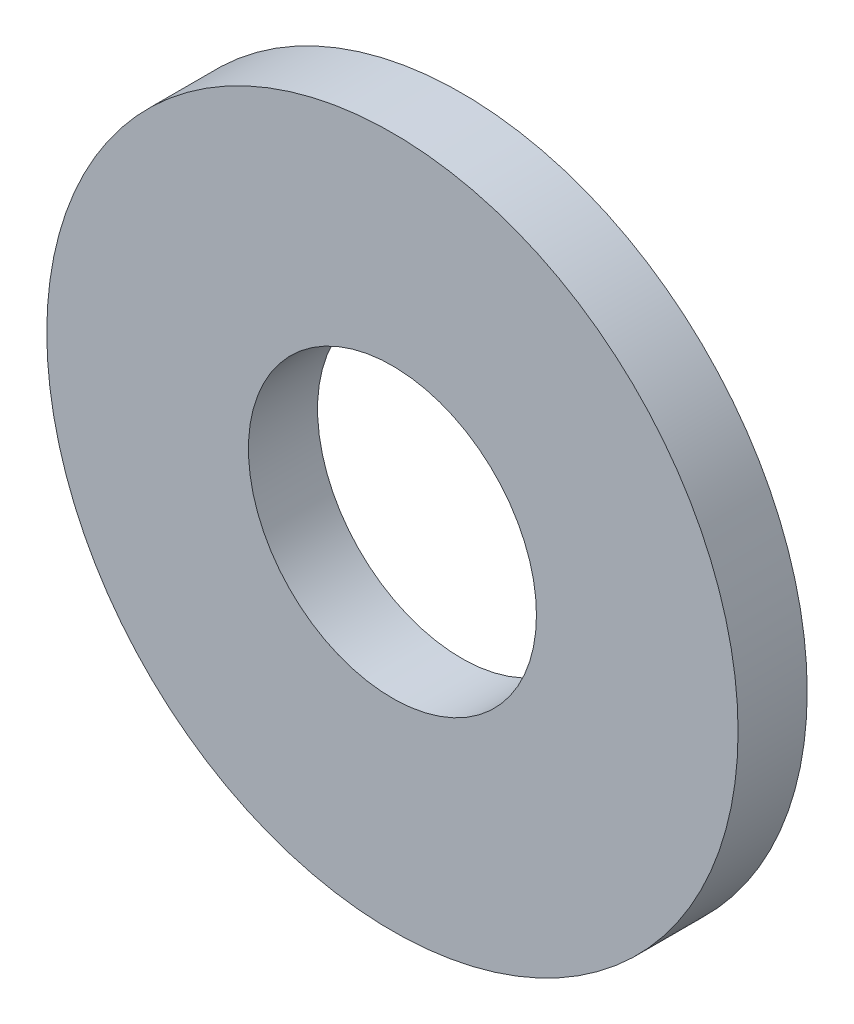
from build123d import *

# Parameters (mm, degrees)
SKETCH1_R           = 3
SKETCH1_R_2         = 1.25
BOSS_EXTRUDE1_DEPTH = 0.6


with BuildPart() as part:
    # Sketch1 → Boss-Extrude1 (new body)
    with BuildSketch(Plane.XY):
        Circle(SKETCH1_R)
        Circle(SKETCH1_R_2, mode=Mode.SUBTRACT)
    extrude(amount=BOSS_EXTRUDE1_DEPTH)


solid = part.part
